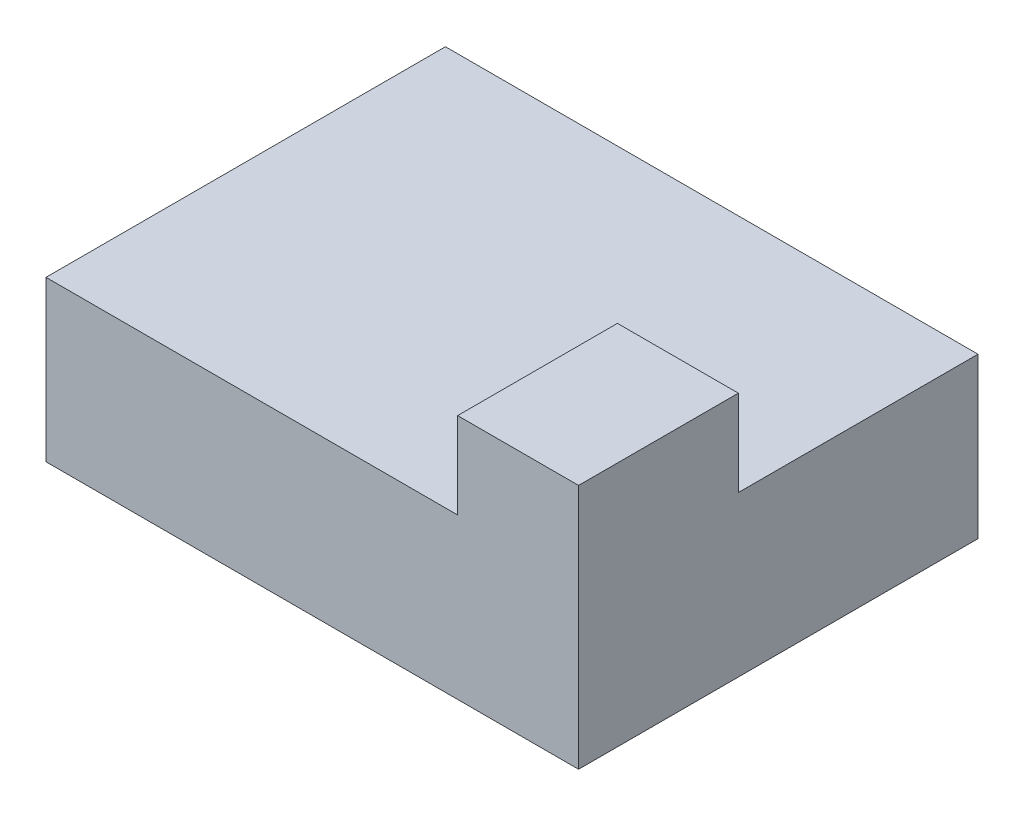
ISO-10303-21;
HEADER;
FILE_DESCRIPTION(('STEP AP214'),'2;1');
FILE_NAME('part.step','',(''),(''),'','','');
FILE_SCHEMA(('AUTOMOTIVE_DESIGN { 1 0 10303 214 1 1 1 1 }'));
ENDSEC;
DATA;
#1=APPLICATION_CONTEXT('core data for automotive mechanical design processes');
#2=APPLICATION_PROTOCOL_DEFINITION('international standard','automotive_design',2000,#1);
#3=PRODUCT_CONTEXT('',#1,'mechanical');
#4=PRODUCT('Part','Part','',(#3));
#5=PRODUCT_RELATED_PRODUCT_CATEGORY('part','',(#4));
#6=PRODUCT_DEFINITION_FORMATION('','',#4);
#7=PRODUCT_DEFINITION_CONTEXT('part definition',#1,'design');
#8=PRODUCT_DEFINITION('design','',#6,#7);
#9=PRODUCT_DEFINITION_SHAPE('','',#8);
#10=(LENGTH_UNIT() NAMED_UNIT(*) SI_UNIT(.MILLI.,.METRE.));
#11=(NAMED_UNIT(*) PLANE_ANGLE_UNIT() SI_UNIT($,.RADIAN.));
#12=(NAMED_UNIT(*) SI_UNIT($,.STERADIAN.) SOLID_ANGLE_UNIT());
#13=UNCERTAINTY_MEASURE_WITH_UNIT(LENGTH_MEASURE(1.E-05),#10,'distance_accuracy_value','');
#14=(GEOMETRIC_REPRESENTATION_CONTEXT(3) GLOBAL_UNCERTAINTY_ASSIGNED_CONTEXT((#13)) GLOBAL_UNIT_ASSIGNED_CONTEXT((#10,
#11,#12)) REPRESENTATION_CONTEXT('',''));
#15=CARTESIAN_POINT('',(0.,0.,0.));
#16=DIRECTION('',(0.,0.,1.));
#17=DIRECTION('',(1.,0.,0.));
#18=AXIS2_PLACEMENT_3D('',#15,#16,#17);
#19=CARTESIAN_POINT('',(-50.,30.,-37.5));
#20=DIRECTION('',(1.,0.,0.));
#21=DIRECTION('',(0.,0.,-1.));
#22=AXIS2_PLACEMENT_3D('',#19,#20,#21);
#23=PLANE('',#22);
#24=DIRECTION('',(0.,0.,1.));
#25=VECTOR('',#24,1.);
#26=CARTESIAN_POINT('',(-50.,0.,-37.5));
#27=LINE('',#26,#25);
#28=CARTESIAN_POINT('',(-50.,0.,-37.5));
#29=VERTEX_POINT('',#28);
#30=CARTESIAN_POINT('',(-50.,0.,37.5));
#31=VERTEX_POINT('',#30);
#32=EDGE_CURVE('E141',#29,#31,#27,.T.);
#33=ORIENTED_EDGE('',*,*,#32,.T.);
#34=DIRECTION('',(0.,-1.,0.));
#35=VECTOR('',#34,1.);
#36=CARTESIAN_POINT('',(-50.,30.,37.5));
#37=LINE('',#36,#35);
#38=CARTESIAN_POINT('',(-50.,30.,37.5));
#39=VERTEX_POINT('',#38);
#40=EDGE_CURVE('E11',#39,#31,#37,.T.);
#41=ORIENTED_EDGE('',*,*,#40,.F.);
#42=DIRECTION('',(0.,0.,1.));
#43=VECTOR('',#42,1.);
#44=CARTESIAN_POINT('',(-50.,30.,-37.5));
#45=LINE('',#44,#43);
#46=CARTESIAN_POINT('',(-50.,30.,-37.5));
#47=VERTEX_POINT('',#46);
#48=EDGE_CURVE('E107',#47,#39,#45,.T.);
#49=ORIENTED_EDGE('',*,*,#48,.F.);
#50=DIRECTION('',(0.,-1.,0.));
#51=VECTOR('',#50,1.);
#52=CARTESIAN_POINT('',(-50.,30.,-37.5));
#53=LINE('',#52,#51);
#54=EDGE_CURVE('E123',#47,#29,#53,.T.);
#55=ORIENTED_EDGE('',*,*,#54,.T.);
#56=EDGE_LOOP('',(#33,#41,#49,#55));
#57=FACE_BOUND('',#56,.T.);
#58=ADVANCED_FACE('F26',(#57),#23,.F.);
#59=CARTESIAN_POINT('',(-50.,30.,37.5));
#60=DIRECTION('',(0.,0.,-1.));
#61=DIRECTION('',(-1.,0.,0.));
#62=AXIS2_PLACEMENT_3D('',#59,#60,#61);
#63=PLANE('',#62);
#64=DIRECTION('',(1.,0.,0.));
#65=VECTOR('',#64,1.);
#66=CARTESIAN_POINT('',(-50.,0.,37.5));
#67=LINE('',#66,#65);
#68=CARTESIAN_POINT('',(50.,0.,37.5));
#69=VERTEX_POINT('',#68);
#70=EDGE_CURVE('E139',#31,#69,#67,.T.);
#71=ORIENTED_EDGE('',*,*,#70,.T.);
#72=DIRECTION('',(0.,-1.,0.));
#73=VECTOR('',#72,1.);
#74=CARTESIAN_POINT('',(50.,30.,37.5));
#75=LINE('',#74,#73);
#76=CARTESIAN_POINT('',(50.,46.1616837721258,37.5));
#77=VERTEX_POINT('',#76);
#78=EDGE_CURVE('E34',#77,#69,#75,.T.);
#79=ORIENTED_EDGE('',*,*,#78,.F.);
#80=DIRECTION('',(-1.,0.,0.));
#81=VECTOR('',#80,1.);
#82=CARTESIAN_POINT('',(27.2943626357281,46.1616837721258,37.5));
#83=LINE('',#82,#81);
#84=CARTESIAN_POINT('',(27.2943626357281,46.1616837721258,37.5));
#85=VERTEX_POINT('',#84);
#86=EDGE_CURVE('E104',#77,#85,#83,.T.);
#87=ORIENTED_EDGE('',*,*,#86,.T.);
#88=DIRECTION('',(0.,-1.,0.));
#89=VECTOR('',#88,1.);
#90=CARTESIAN_POINT('',(27.2943626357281,30.,37.5));
#91=LINE('',#90,#89);
#92=CARTESIAN_POINT('',(27.2943626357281,30.,37.5));
#93=VERTEX_POINT('',#92);
#94=EDGE_CURVE('E92',#85,#93,#91,.T.);
#95=ORIENTED_EDGE('',*,*,#94,.T.);
#96=DIRECTION('',(1.,0.,0.));
#97=VECTOR('',#96,1.);
#98=CARTESIAN_POINT('',(-50.,30.,37.5));
#99=LINE('',#98,#97);
#100=EDGE_CURVE('E102',#39,#93,#99,.T.);
#101=ORIENTED_EDGE('',*,*,#100,.F.);
#102=ORIENTED_EDGE('',*,*,#40,.T.);
#103=EDGE_LOOP('',(#71,#79,#87,#95,#101,#102));
#104=FACE_BOUND('',#103,.T.);
#105=ADVANCED_FACE('F101',(#104),#63,.F.);
#106=CARTESIAN_POINT('',(50.,30.,-37.5));
#107=DIRECTION('',(-1.,0.,0.));
#108=DIRECTION('',(0.,0.,1.));
#109=AXIS2_PLACEMENT_3D('',#106,#107,#108);
#110=PLANE('',#109);
#111=DIRECTION('',(0.,0.,-1.));
#112=VECTOR('',#111,1.);
#113=CARTESIAN_POINT('',(50.,0.,-37.5));
#114=LINE('',#113,#112);
#115=CARTESIAN_POINT('',(50.,0.,-37.5));
#116=VERTEX_POINT('',#115);
#117=EDGE_CURVE('E134',#69,#116,#114,.T.);
#118=ORIENTED_EDGE('',*,*,#117,.T.);
#119=DIRECTION('',(0.,-1.,0.));
#120=VECTOR('',#119,1.);
#121=CARTESIAN_POINT('',(50.,30.,-37.5));
#122=LINE('',#121,#120);
#123=CARTESIAN_POINT('',(50.,30.,-37.5));
#124=VERTEX_POINT('',#123);
#125=EDGE_CURVE('E126',#124,#116,#122,.T.);
#126=ORIENTED_EDGE('',*,*,#125,.F.);
#127=DIRECTION('',(0.,0.,-1.));
#128=VECTOR('',#127,1.);
#129=CARTESIAN_POINT('',(50.,30.,-37.5));
#130=LINE('',#129,#128);
#131=CARTESIAN_POINT('',(50.,30.,7.5));
#132=VERTEX_POINT('',#131);
#133=EDGE_CURVE('E109',#132,#124,#130,.T.);
#134=ORIENTED_EDGE('',*,*,#133,.F.);
#135=DIRECTION('',(0.,1.,0.));
#136=VECTOR('',#135,1.);
#137=CARTESIAN_POINT('',(50.,30.,7.5));
#138=LINE('',#137,#136);
#139=CARTESIAN_POINT('',(50.,46.1616837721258,7.5));
#140=VERTEX_POINT('',#139);
#141=EDGE_CURVE('E42',#132,#140,#138,.T.);
#142=ORIENTED_EDGE('',*,*,#141,.T.);
#143=DIRECTION('',(0.,0.,1.));
#144=VECTOR('',#143,1.);
#145=CARTESIAN_POINT('',(50.,46.1616837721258,7.5));
#146=LINE('',#145,#144);
#147=EDGE_CURVE('E97',#140,#77,#146,.T.);
#148=ORIENTED_EDGE('',*,*,#147,.T.);
#149=ORIENTED_EDGE('',*,*,#78,.T.);
#150=EDGE_LOOP('',(#118,#126,#134,#142,#148,#149));
#151=FACE_BOUND('',#150,.T.);
#152=ADVANCED_FACE('F132',(#151),#110,.F.);
#153=CARTESIAN_POINT('',(-50.,30.,-37.5));
#154=DIRECTION('',(0.,0.,1.));
#155=DIRECTION('',(1.,0.,0.));
#156=AXIS2_PLACEMENT_3D('',#153,#154,#155);
#157=PLANE('',#156);
#158=DIRECTION('',(-1.,0.,0.));
#159=VECTOR('',#158,1.);
#160=CARTESIAN_POINT('',(-50.,0.,-37.5));
#161=LINE('',#160,#159);
#162=EDGE_CURVE('E112',#116,#29,#161,.T.);
#163=ORIENTED_EDGE('',*,*,#162,.T.);
#164=ORIENTED_EDGE('',*,*,#54,.F.);
#165=DIRECTION('',(-1.,0.,0.));
#166=VECTOR('',#165,1.);
#167=CARTESIAN_POINT('',(-50.,30.,-37.5));
#168=LINE('',#167,#166);
#169=EDGE_CURVE('E50',#124,#47,#168,.T.);
#170=ORIENTED_EDGE('',*,*,#169,.F.);
#171=ORIENTED_EDGE('',*,*,#125,.T.);
#172=EDGE_LOOP('',(#163,#164,#170,#171));
#173=FACE_BOUND('',#172,.T.);
#174=ADVANCED_FACE('F179',(#173),#157,.F.);
#175=CARTESIAN_POINT('',(-50.,30.,37.5));
#176=DIRECTION('',(0.,1.,0.));
#177=DIRECTION('',(0.,0.,1.));
#178=AXIS2_PLACEMENT_3D('',#175,#176,#177);
#179=PLANE('',#178);
#180=DIRECTION('',(0.,0.,1.));
#181=VECTOR('',#180,1.);
#182=CARTESIAN_POINT('',(27.2943626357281,30.,7.5));
#183=LINE('',#182,#181);
#184=CARTESIAN_POINT('',(27.2943626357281,30.,7.5));
#185=VERTEX_POINT('',#184);
#186=EDGE_CURVE('E89',#185,#93,#183,.T.);
#187=ORIENTED_EDGE('',*,*,#186,.F.);
#188=DIRECTION('',(1.,0.,0.));
#189=VECTOR('',#188,1.);
#190=CARTESIAN_POINT('',(27.2943626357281,30.,7.5));
#191=LINE('',#190,#189);
#192=EDGE_CURVE('E154',#185,#132,#191,.T.);
#193=ORIENTED_EDGE('',*,*,#192,.T.);
#194=ORIENTED_EDGE('',*,*,#133,.T.);
#195=ORIENTED_EDGE('',*,*,#169,.T.);
#196=ORIENTED_EDGE('',*,*,#48,.T.);
#197=ORIENTED_EDGE('',*,*,#100,.T.);
#198=EDGE_LOOP('',(#187,#193,#194,#195,#196,#197));
#199=FACE_BOUND('',#198,.T.);
#200=ADVANCED_FACE('F105',(#199),#179,.T.);
#201=CARTESIAN_POINT('',(-50.,0.,37.5));
#202=DIRECTION('',(0.,1.,0.));
#203=DIRECTION('',(0.,0.,1.));
#204=AXIS2_PLACEMENT_3D('',#201,#202,#203);
#205=PLANE('',#204);
#206=ORIENTED_EDGE('',*,*,#32,.F.);
#207=ORIENTED_EDGE('',*,*,#162,.F.);
#208=ORIENTED_EDGE('',*,*,#117,.F.);
#209=ORIENTED_EDGE('',*,*,#70,.F.);
#210=EDGE_LOOP('',(#206,#207,#208,#209));
#211=FACE_BOUND('',#210,.T.);
#212=ADVANCED_FACE('F138',(#211),#205,.F.);
#213=CARTESIAN_POINT('',(27.2943626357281,30.,7.5));
#214=DIRECTION('',(-1.,0.,0.));
#215=DIRECTION('',(0.,0.,1.));
#216=AXIS2_PLACEMENT_3D('',#213,#214,#215);
#217=PLANE('',#216);
#218=ORIENTED_EDGE('',*,*,#94,.F.);
#219=DIRECTION('',(0.,0.,1.));
#220=VECTOR('',#219,1.);
#221=CARTESIAN_POINT('',(27.2943626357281,46.1616837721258,7.5));
#222=LINE('',#221,#220);
#223=CARTESIAN_POINT('',(27.2943626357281,46.1616837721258,7.5));
#224=VERTEX_POINT('',#223);
#225=EDGE_CURVE('E146',#224,#85,#222,.T.);
#226=ORIENTED_EDGE('',*,*,#225,.F.);
#227=DIRECTION('',(0.,-1.,0.));
#228=VECTOR('',#227,1.);
#229=CARTESIAN_POINT('',(27.2943626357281,30.,7.5));
#230=LINE('',#229,#228);
#231=EDGE_CURVE('E95',#224,#185,#230,.T.);
#232=ORIENTED_EDGE('',*,*,#231,.T.);
#233=ORIENTED_EDGE('',*,*,#186,.T.);
#234=EDGE_LOOP('',(#218,#226,#232,#233));
#235=FACE_BOUND('',#234,.T.);
#236=ADVANCED_FACE('F91',(#235),#217,.T.);
#237=CARTESIAN_POINT('',(27.2943626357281,46.1616837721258,7.5));
#238=DIRECTION('',(0.,1.,0.));
#239=DIRECTION('',(0.,0.,1.));
#240=AXIS2_PLACEMENT_3D('',#237,#238,#239);
#241=PLANE('',#240);
#242=ORIENTED_EDGE('',*,*,#86,.F.);
#243=ORIENTED_EDGE('',*,*,#147,.F.);
#244=DIRECTION('',(-1.,0.,0.));
#245=VECTOR('',#244,1.);
#246=CARTESIAN_POINT('',(27.2943626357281,46.1616837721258,7.5));
#247=LINE('',#246,#245);
#248=EDGE_CURVE('E98',#140,#224,#247,.T.);
#249=ORIENTED_EDGE('',*,*,#248,.T.);
#250=ORIENTED_EDGE('',*,*,#225,.T.);
#251=EDGE_LOOP('',(#242,#243,#249,#250));
#252=FACE_BOUND('',#251,.T.);
#253=ADVANCED_FACE('F163',(#252),#241,.T.);
#254=CARTESIAN_POINT('',(27.2943626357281,46.1616837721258,7.5));
#255=DIRECTION('',(0.,0.,-1.));
#256=DIRECTION('',(-1.,0.,0.));
#257=AXIS2_PLACEMENT_3D('',#254,#255,#256);
#258=PLANE('',#257);
#259=ORIENTED_EDGE('',*,*,#231,.F.);
#260=ORIENTED_EDGE('',*,*,#248,.F.);
#261=ORIENTED_EDGE('',*,*,#141,.F.);
#262=ORIENTED_EDGE('',*,*,#192,.F.);
#263=EDGE_LOOP('',(#259,#260,#261,#262));
#264=FACE_BOUND('',#263,.T.);
#265=ADVANCED_FACE('F161',(#264),#258,.T.);
#266=CLOSED_SHELL('',(#58,#105,#152,#174,#200,#212,#236,#253,#265));
#267=MANIFOLD_SOLID_BREP('B2',#266);
#268=ADVANCED_BREP_SHAPE_REPRESENTATION('',(#18,#267),#14);
#269=SHAPE_DEFINITION_REPRESENTATION(#9,#268);
ENDSEC;
END-ISO-10303-21;
